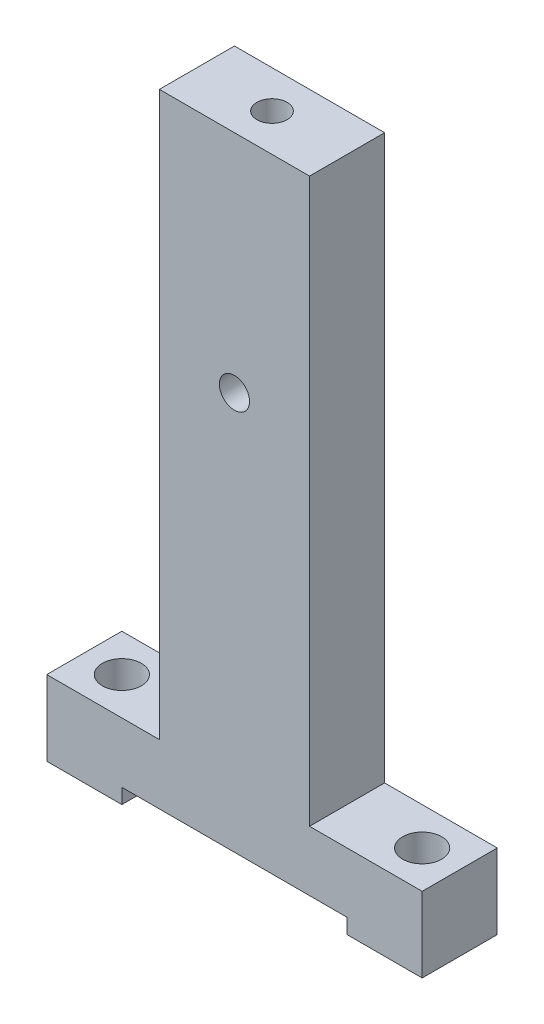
from build123d import *

# Parameters (mm, degrees)
SKETCH1_W                   = 63.5
SKETCH1_H                   = 12.7
BOSS_EXTRUDE1_DEPTH         = 53.975
CUT_EXTRUDE1_REACH          = 65.896
SKETCH2_W                   = 19.05
SKETCH2_H                   = 95.25
SKETCH3_R                   = 3.302
CUT_EXTRUDE2_DEPTH          = 101.602919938
F_1_4_20_TAPPED_HOLE1_D     = 5.1054
F_1_4_20_TAPPED_HOLE1_DEPTH = 19.05
F_1_4_20_TAPPED_HOLE1_TIP   = 1.533816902
SKETCH6_W                   = 38.1
SKETCH6_H                   = 2.54
CUT_EXTRUDE3_DEPTH          = 64.895642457
F_1_4_20_TAPPED_HOLE2_D     = 5.1054
F_1_4_20_TAPPED_HOLE2_DEPTH = 25.4
F_1_4_20_TAPPED_HOLE2_TIP   = 1.533816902


with BuildPart() as part:
    # Sketch1 → Boss-Extrude1 (new, symmetric)
    with BuildSketch(Plane(origin=(0, 0, 0), x_dir=(1, 0, 0), z_dir=(0, 1, 0))):
        Rectangle(SKETCH1_W, SKETCH1_H)
    extrude(amount=BOSS_EXTRUDE1_DEPTH, both=True)

    # Sketch2 → Cut-Extrude1 (cut, up to next)
    with BuildSketch(Plane.XY.offset(6.35), mode=Mode.PRIVATE) as cut_extrude1_sk1:
        with Locations((-22.225, 6.35)):
            Rectangle(SKETCH2_W, SKETCH2_H)
    cut_extrude1_tool1 = extrude(cut_extrude1_sk1.sketch, amount=-CUT_EXTRUDE1_REACH, mode=Mode.PRIVATE) & part.part
    # Sketch2 → Cut-Extrude1 (cut, up to next)
    with BuildSketch(Plane.XY.offset(6.35), mode=Mode.PRIVATE) as cut_extrude1_sk2:
        with Locations((22.225, 6.35)):
            Rectangle(SKETCH2_W, SKETCH2_H)
    cut_extrude1_tool2 = extrude(cut_extrude1_sk2.sketch, amount=-CUT_EXTRUDE1_REACH, mode=Mode.PRIVATE) & part.part
    add(cut_extrude1_tool1.solids().sort_by_distance((-22.225, 6.35, 6.35))[0], mode=Mode.SUBTRACT)
    add(cut_extrude1_tool2.solids().sort_by_distance((22.225, 6.35, 6.35))[0], mode=Mode.SUBTRACT)

    # Sketch3 → Cut-Extrude2 (cut, through all)
    with BuildSketch(Plane(origin=(0, -41.275, 0), x_dir=(1, 0, 0), z_dir=(0, 1, 0))):
        with Locations(Location((-25.4, 0, 0), (0, 0, 270))):
            Circle(SKETCH3_R)
        with Locations(Location((25.4, 0, 0), (0, 0, 270))):
            Circle(SKETCH3_R)
    extrude(amount=-CUT_EXTRUDE2_DEPTH, mode=Mode.SUBTRACT)

    # 1_4-20 Tapped Hole1
    with Locations(Plane(origin=(0, 53.975, 0), x_dir=(1, 0, 0), z_dir=(0, 1, 0))):
        with Locations((0, 0)):
            Hole(F_1_4_20_TAPPED_HOLE1_D / 2, depth=F_1_4_20_TAPPED_HOLE1_DEPTH)
            with Locations((0, 0, -(F_1_4_20_TAPPED_HOLE1_DEPTH + F_1_4_20_TAPPED_HOLE1_TIP / 2))):  # 118° drill point
                Cone(0, F_1_4_20_TAPPED_HOLE1_D / 2, F_1_4_20_TAPPED_HOLE1_TIP, mode=Mode.SUBTRACT)

    # Sketch6 → Cut-Extrude3 (cut, through all)
    with BuildSketch(Plane.XY.offset(6.35)):
        with Locations((0, -52.705)):
            Rectangle(SKETCH6_W, SKETCH6_H)
    extrude(amount=-CUT_EXTRUDE3_DEPTH, mode=Mode.SUBTRACT)

    # 1_4-20 Tapped Hole2
    with Locations(Plane.XY.offset(6.35)):
        with Locations((0, 15.875)):
            Hole(F_1_4_20_TAPPED_HOLE2_D / 2, depth=F_1_4_20_TAPPED_HOLE2_DEPTH)
            with Locations((0, 0, -(F_1_4_20_TAPPED_HOLE2_DEPTH + F_1_4_20_TAPPED_HOLE2_TIP / 2))):  # 118° drill point
                Cone(0, F_1_4_20_TAPPED_HOLE2_D / 2, F_1_4_20_TAPPED_HOLE2_TIP, mode=Mode.SUBTRACT)


solid = part.part
